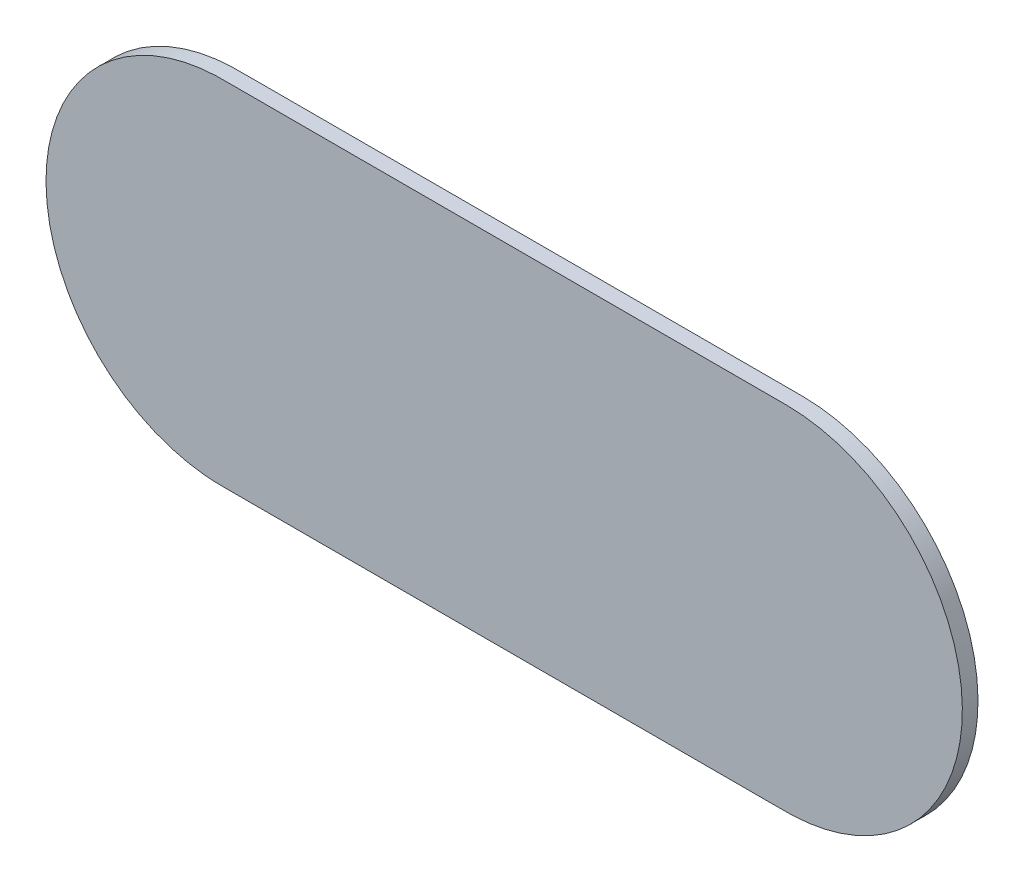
from build123d import *

# Parameters (mm, degrees)
BASE_EXTRUDE_DEPTH      = 12.7
CUT_EXTRUDE4_DEPTH      = 2.54
CUT_EXTRUDE4_DEPTH_BACK = 629.489626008
SKETCH2_OUTSIDE_W       = 928.16
SKETCH2_OUTSIDE_H       = 470.96


with BuildPart() as part:
    # Sketch1 → Base-Extrude (new body)
    with BuildSketch(Plane.XY):
        with BuildLine():
            Line((457.2, 152.4), (0, 152.4))
            ThreePointArc((0, 152.4), (-152.4, 0), (0, -152.4))
            Line((0, -152.4), (457.2, -152.4))
            ThreePointArc((457.2, -152.4), (609.6, 0), (457.2, 152.4))
        make_face()
    extrude(amount=-BASE_EXTRUDE_DEPTH)

    # Sketch2 outside → Cut-Extrude4 (cut, two sides: drawn at the far end of the back side and taken through both)
    with BuildSketch(Plane.XY.offset(-CUT_EXTRUDE4_DEPTH_BACK)):
        with Locations((228.6, 0)):
            Rectangle(SKETCH2_OUTSIDE_W, SKETCH2_OUTSIDE_H)
        with BuildLine():
            add(Edge.make_bspline(
                [(0.659988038, -142.875), (152.619996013, -142.875), (304.580003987, -142.875), (456.540011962, -142.875), (456.613343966, -142.875), (456.760007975, -142.875), (456.980003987, -142.875), (457.126667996, -142.875), (457.2, -142.875), (457.271993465, -142.875), (457.415980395, -142.875), (457.631960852, -142.87440143), (457.775946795, -142.873857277), (457.84793952, -142.873530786), (741.023653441, -141.589312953), (741.023653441, 141.589312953), (457.84793952, 142.873530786), (457.775946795, 142.873857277), (457.631960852, 142.87440143), (457.415980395, 142.875), (457.271993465, 142.875), (457.2, 142.875), (457.126667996, 142.875), (456.980003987, 142.875), (456.760007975, 142.875), (456.613343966, 142.875), (456.540011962, 142.875), (304.580003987, 142.875), (152.619996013, 142.875), (0.659988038, 142.875), (0.586656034, 142.875), (0.439992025, 142.875), (0.219996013, 142.875), (0.073332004, 142.875), (0, 142.875), (-0.071993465, 142.875), (-0.215980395, 142.875), (-0.431960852, 142.87440143), (-0.575946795, 142.873857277), (-0.64793952, 142.873530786), (-283.823653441, 141.589312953), (-283.823653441, -141.589312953), (-0.64793952, -142.873530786), (-0.575946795, -142.873857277), (-0.431960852, -142.87440143), (-0.215980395, -142.875), (-0.071993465, -142.875), (0, -142.875), (0.073332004, -142.875), (0.219996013, -142.875), (0.439992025, -142.875), (0.586656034, -142.875), (0.659988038, -142.875)],
                knots=[0, 0, 0, 0, 0.306270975, 0.306270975, 0.306270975, 0.306418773, 0.306566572, 0.30671437, 0.30671437, 0.30671437, 0.306859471, 0.307004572, 0.307149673, 0.307149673, 0.307149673, 0.499121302, 0.499121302, 0.499121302, 0.499266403, 0.499411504, 0.499556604, 0.499556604, 0.499556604, 0.499704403, 0.499852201, 0.5, 0.5, 0.5, 0.806270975, 0.806270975, 0.806270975, 0.806418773, 0.806566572, 0.80671437, 0.80671437, 0.80671437, 0.806859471, 0.807004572, 0.807149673, 0.807149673, 0.807149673, 0.999121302, 0.999121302, 0.999121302, 0.999266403, 0.999411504, 0.999556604, 0.999556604, 0.999556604, 0.999704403, 0.999852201, 1, 1, 1, 1], degree=3, weights=[1, 1, 1, 1, 1, 1, 1, 1, 1, 1, 1, 1, 1, 1, 0.336356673, 0.336356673, 1, 1, 1, 1, 1, 1, 1, 1, 1, 1, 1, 1, 1, 1, 1, 1, 1, 1, 1, 1, 1, 1, 1, 1, 0.336356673, 0.336356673, 1, 1, 1, 1, 1, 1, 1, 1, 1, 1, 1]))
        make_face(mode=Mode.SUBTRACT)
    extrude(amount=CUT_EXTRUDE4_DEPTH + CUT_EXTRUDE4_DEPTH_BACK, mode=Mode.SUBTRACT)


solid = part.part
